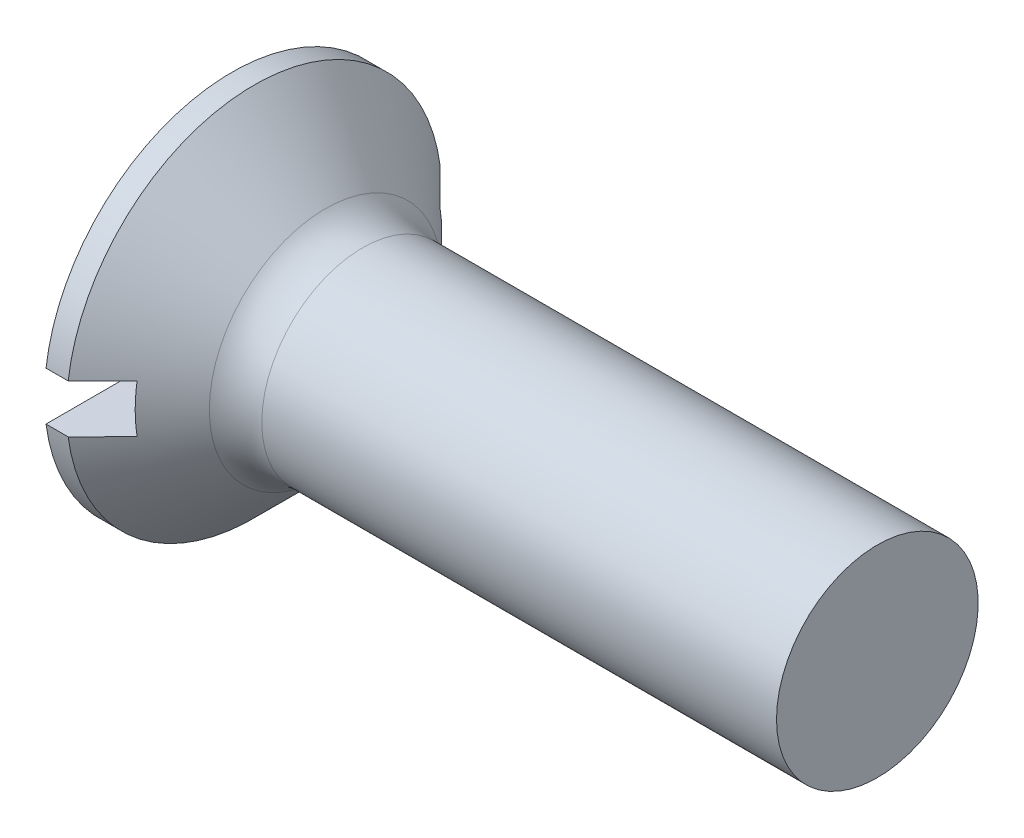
from build123d import *

# Parameters (mm, degrees)
FILLET1_R  = 1.3
SKETCH2_W  = 9.3
SKETCH2_H  = 1.2
SLOT_DEPTH = 1.4


with BuildPart() as part:
    # BodySke → Base-Revolve (revolve)
    with BuildSketch(Plane.XY, mode=Mode.PRIVATE) as base_revolve_sk:
        Polygon((0, 0), (0, 4.65), (0.55, 4.65), (2.7, 2.5), (16, 2.5), (16, 0), align=None)
    revolve(base_revolve_sk.sketch.rotate(Axis((-6.35, 0, 0), (1, 0, 0)), 90), axis=Axis((-6.35, 0, 0), (1, 0, 0)))

    # Fillet1
    fillet1_edges = [part.edges().sort_by_distance(p)[0] for p in [
        (2.7, 0, -2.5),
    ]]
    fillet(fillet1_edges, radius=FILLET1_R)

    # Sketch2 → Slot (cut)
    with BuildSketch(Plane.ZY):
        Rectangle(SKETCH2_W, SKETCH2_H)
    extrude(amount=-SLOT_DEPTH, mode=Mode.SUBTRACT)


solid = part.part
